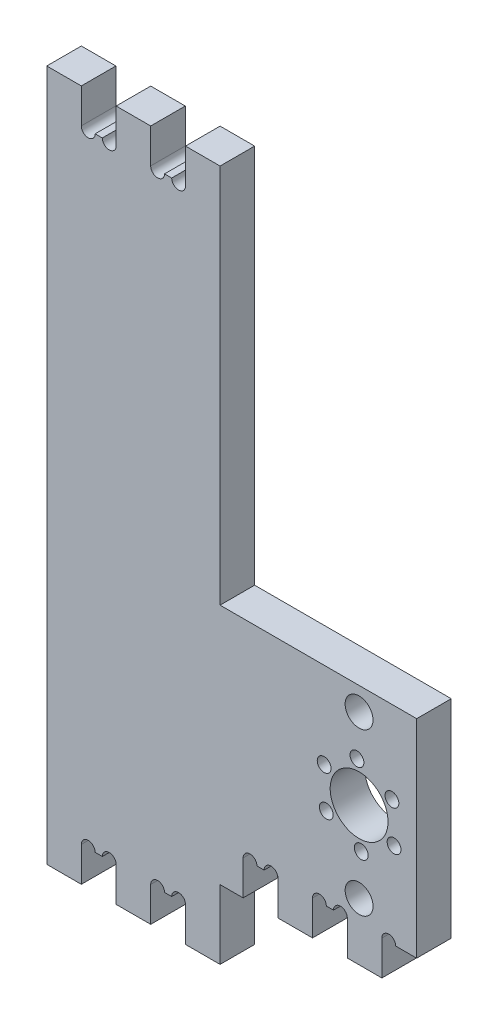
from build123d import *

# Parameters (mm, degrees)
OUTLINE_DEPTH = 15
SKIZZE2_R     = 6.05
SKIZZE2_R_2   = 12.55
INNER_DEPTH   = 15
SKIZZE3_R     = 3
HOLES_DEPTH   = 20


with BuildPart() as part:
    # Skizze1 → outline (new body)
    with BuildSketch(Plane.XY):
        with BuildLine():
            Line((14.679285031, -15), (14.679285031, -40))
            Line((14.679285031, -40), (14.679285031, -45))
            Line((14.679285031, -45), (-0.320714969, -45))
            Line((-0.320714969, -45), (-0.320714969, -30))
            ThreePointArc((-0.320714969, -30), (-3.320714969, -27), (-6.320714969, -30))
            Line((-6.320714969, -30), (-9.420714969, -30))
            ThreePointArc((-9.420714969, -30), (-12.420714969, -27), (-15.420714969, -30))
            Line((-15.420714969, -30), (-15.420714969, -45))
            Line((-15.420714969, -45), (-30.420714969, -45))
            Line((-30.420714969, -45), (-30.420714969, -30))
            ThreePointArc((-30.420714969, -30), (-33.420714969, -27), (-36.420714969, -30))
            Line((-36.420714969, -30), (-39.520714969, -30))
            ThreePointArc((-39.520714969, -30), (-42.520714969, -27), (-45.520714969, -30))
            Line((-45.520714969, -30), (-45.520714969, -45))
            Line((-45.520714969, -45), (-60.520714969, -45))
            Line((-60.520714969, -45), (-60.520714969, -40))
            Line((-60.520714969, -40), (-60.520714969, 160))
            Line((-60.520714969, 160), (-60.520714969, 255))
            Line((-60.520714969, 255), (-45.520714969, 255))
            Line((-45.520714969, 255), (-45.520714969, 240))
            ThreePointArc((-45.520714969, 240), (-42.520714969, 237), (-39.520714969, 240))
            Line((-39.520714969, 240), (-36.420714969, 240))
            ThreePointArc((-36.420714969, 240), (-33.420714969, 237), (-30.420714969, 240))
            Line((-30.420714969, 240), (-30.420714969, 255))
            Line((-30.420714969, 255), (-15.420714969, 255))
            Line((-15.420714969, 255), (-15.420714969, 240))
            ThreePointArc((-15.420714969, 240), (-12.420714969, 237), (-9.420714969, 240))
            Line((-9.420714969, 240), (-6.320714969, 240))
            ThreePointArc((-6.320714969, 240), (-3.320714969, 237), (-0.320714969, 240))
            Line((-0.320714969, 240), (-0.320714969, 255))
            Line((-0.320714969, 255), (14.679285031, 255))
            Line((14.679285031, 255), (14.679285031, 240))
            Line((14.679285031, 240), (14.679285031, 90))
            Line((14.679285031, 90), (99.979285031, 90))
            Line((99.979285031, 90), (99.979285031, 0))
            Line((99.979285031, 0), (90.879285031, 0))
            ThreePointArc((90.879285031, 0), (87.879285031, 3), (84.879285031, 0))
            Line((84.879285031, 0), (84.879285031, -15))
            Line((84.879285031, -15), (69.879285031, -15))
            Line((69.879285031, -15), (69.879285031, 0))
            ThreePointArc((69.879285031, 0), (66.879285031, 3), (63.879285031, 0))
            Line((63.879285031, 0), (60.779285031, 0))
            ThreePointArc((60.779285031, 0), (57.779285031, 3), (54.779285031, 0))
            Line((54.779285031, 0), (54.779285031, -15))
            Line((54.779285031, -15), (39.779285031, -15))
            Line((39.779285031, -15), (39.779285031, 0))
            ThreePointArc((39.779285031, 0), (36.779285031, 3), (33.779285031, 0))
            Line((33.779285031, 0), (30.679285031, 0))
            ThreePointArc((30.679285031, 0), (27.679285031, 3), (24.679285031, 0))
            Line((24.679285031, 0), (24.679285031, -15))
            Line((24.679285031, -15), (14.679285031, -15))
        make_face()
    extrude(amount=OUTLINE_DEPTH)

    # Skizze2 → inner (cut)
    with BuildSketch(Plane.XY.offset(15)):
        with Locations((74.979285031, 80)):
            Circle(SKIZZE2_R)
        with Locations((74.999999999, 45.000003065)):
            Circle(SKIZZE2_R_2)
        with Locations((74.999999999, 10.000003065)):
            Circle(SKIZZE2_R)
    extrude(amount=-INNER_DEPTH, mode=Mode.SUBTRACT)

    # Skizze3 → holes (cut)
    with BuildSketch(Plane(origin=(0, 0, 0), x_dir=(-1, 0, 0), z_dir=(0, 0, -1))):
        with Locations((-74.072169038, 61.974664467)):
            Circle(SKIZZE3_R)
        with Locations((-59.835596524, 52.683808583)):
            Circle(SKIZZE3_R)
        with Locations((-60.763427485, 35.709147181)):
            Circle(SKIZZE3_R)
        with Locations((-75.92783096, 28.025341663)):
            Circle(SKIZZE3_R)
        with Locations((-90.164403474, 37.316197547)):
            Circle(SKIZZE3_R)
        with Locations((-89.236572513, 54.290858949)):
            Circle(SKIZZE3_R)
    extrude(amount=-HOLES_DEPTH, mode=Mode.SUBTRACT)


solid = part.part
